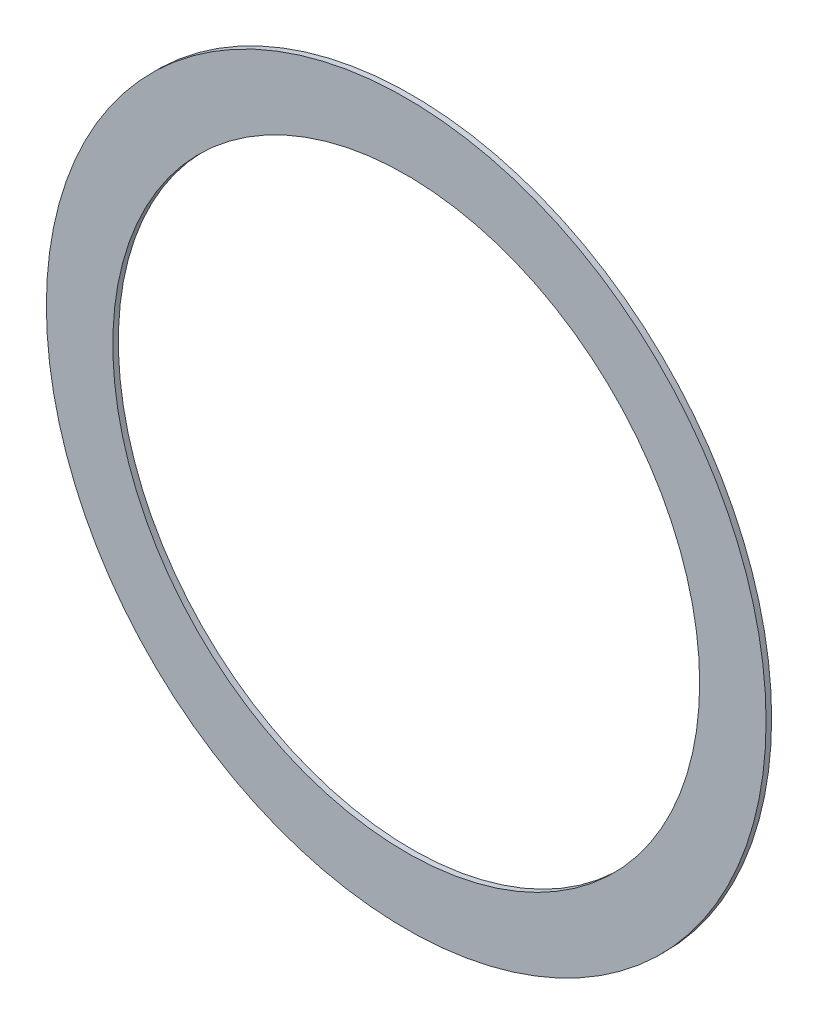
from build123d import *

# Parameters (mm, degrees)
SKETCH1_R      = 206.375
SKETCH1_R_2    = 168.275
EXTRUDE1_DEPTH = 3.175


with BuildPart() as part:
    # Sketch1 → Extrude1 (new body)
    with BuildSketch(Plane.XY):
        Circle(SKETCH1_R)
        Circle(SKETCH1_R_2, mode=Mode.SUBTRACT)
    extrude(amount=EXTRUDE1_DEPTH)


solid = part.part
